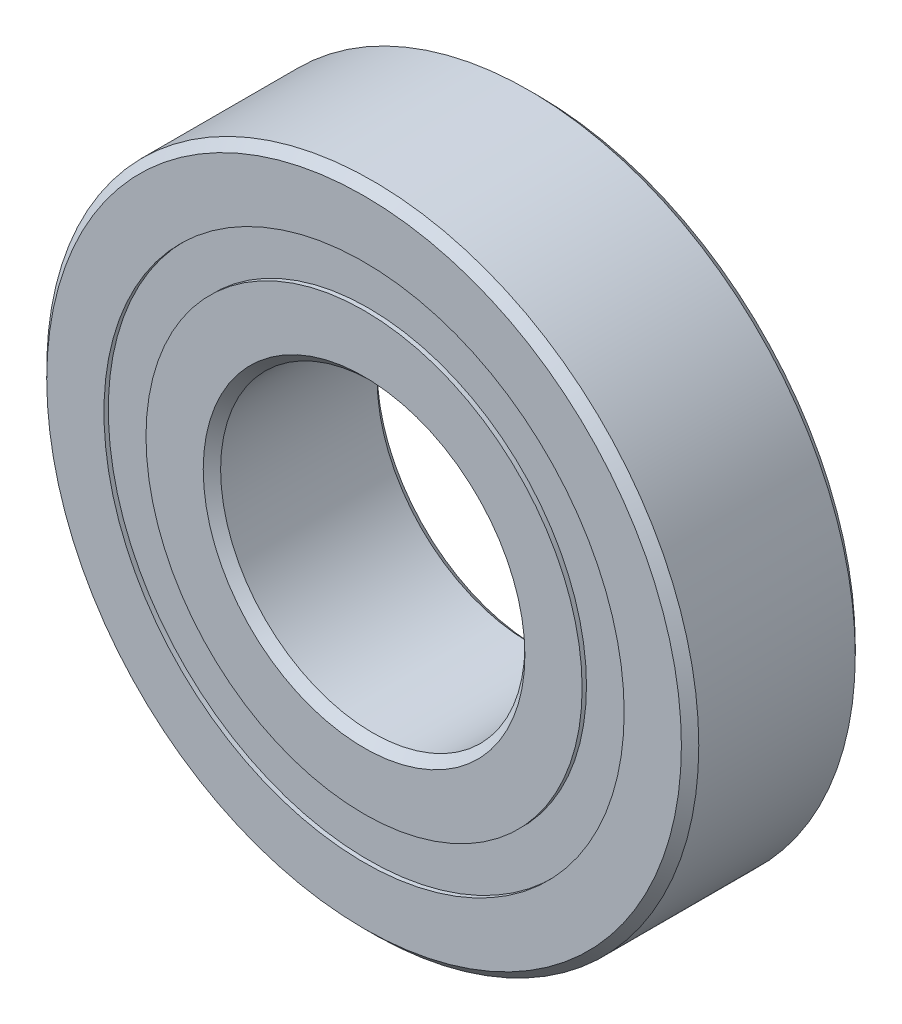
from build123d import *

# Parameters (mm, degrees)
CIRPATTERN1_COUNT = 12
SKETCH5_W         = 2.819764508
SKETCH5_H         = 3.07032967


with BuildPart() as part:
    # Sketch1 → Revolve1 (revolve)
    with BuildSketch(Plane(origin=(0, 0, 0), x_dir=(0, 0, -1), z_dir=(1, 0, 0)), mode=Mode.PRIVATE) as revolve1_sk:
        with BuildLine():
            Line((5.715, 23.8125), (-5.715, 23.8125))
            Line((-5.715, 23.8125), (-6.35, 23.1775))
            Line((-6.35, 23.1775), (-6.35, 18.997664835))
            Line((-6.35, 18.997664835), (-2.822222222, 18.997664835))
            ThreePointArc((-2.822222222, 18.997664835), (0, 20.675235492), (2.822222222, 18.997664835))
            Line((2.822222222, 18.997664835), (6.35, 18.997664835))
            Line((6.35, 18.997664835), (6.35, 23.1775))
            Line((6.35, 23.1775), (5.715, 23.8125))
        make_face()
    revolve(revolve1_sk.sketch.rotate(Axis((0, 0, 6.35), (0, 0, -1)), 90), axis=Axis((0, 0, 6.35), (0, 0, -1)))


with BuildPart() as body_2:
    # Sketch3 → Revolve3 (revolve)
    with BuildSketch(Plane(origin=(0, 0, 0), x_dir=(0, 0, -1), z_dir=(1, 0, 0)), mode=Mode.PRIVATE) as revolve3_sk:
        with BuildLine():
            Line((-6.35, 15.927335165), (-2.822222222, 15.927335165))
            ThreePointArc((-2.822222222, 15.927335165), (0, 14.249764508), (2.822222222, 15.927335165))
            Line((2.822222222, 15.927335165), (6.35, 15.927335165))
            Line((6.35, 15.927335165), (6.35, 11.7475))
            Line((6.35, 11.7475), (5.715, 11.1125))
            Line((5.715, 11.1125), (-5.715, 11.1125))
            Line((-5.715, 11.1125), (-6.35, 11.7475))
            Line((-6.35, 11.7475), (-6.35, 15.927335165))
        make_face()
    revolve(revolve3_sk.sketch.rotate(Axis((0, 0, 6.35), (0, 0, -1)), 90), axis=Axis((0, 0, 6.35), (0, 0, -1)))


with BuildPart() as body_3:
    # Sketch4 → Revolve4 (revolve)
    with BuildSketch(Plane(origin=(0, 0, 0), x_dir=(0, 0, -1), z_dir=(1, 0, 0))):
        with BuildLine():
            Line((-3.212735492, 17.4625), (3.212735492, 17.4625))
            ThreePointArc((3.212735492, 17.4625), (0, 20.675235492), (-3.212735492, 17.4625))
        make_face()
    revolve(axis=Axis((0, 17.4625, 3.212735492), (0, 0, -1)))


with BuildPart() as cirpattern1_1:
    # CirPattern1: pattern copy
    add(body_3.part.rotate(Axis((0, 0, 0), (0, 0, 1)), 1 * 360 / CIRPATTERN1_COUNT))


with BuildPart() as cirpattern1_2:
    # CirPattern1: pattern copy
    add(body_3.part.rotate(Axis((0, 0, 0), (0, 0, 1)), 2 * 360 / CIRPATTERN1_COUNT))


with BuildPart() as cirpattern1_3:
    # CirPattern1: pattern copy
    add(body_3.part.rotate(Axis((0, 0, 0), (0, 0, 1)), 3 * 360 / CIRPATTERN1_COUNT))


with BuildPart() as cirpattern1_4:
    # CirPattern1: pattern copy
    add(body_3.part.rotate(Axis((0, 0, 0), (0, 0, 1)), 4 * 360 / CIRPATTERN1_COUNT))


with BuildPart() as cirpattern1_5:
    # CirPattern1: pattern copy
    add(body_3.part.rotate(Axis((0, 0, 0), (0, 0, 1)), 5 * 360 / CIRPATTERN1_COUNT))


with BuildPart() as cirpattern1_6:
    # CirPattern1: pattern copy
    add(body_3.part.rotate(Axis((0, 0, 0), (0, 0, 1)), 6 * 360 / CIRPATTERN1_COUNT))


with BuildPart() as cirpattern1_7:
    # CirPattern1: pattern copy
    add(body_3.part.rotate(Axis((0, 0, 0), (0, 0, 1)), 7 * 360 / CIRPATTERN1_COUNT))


with BuildPart() as cirpattern1_8:
    # CirPattern1: pattern copy
    add(body_3.part.rotate(Axis((0, 0, 0), (0, 0, 1)), 8 * 360 / CIRPATTERN1_COUNT))


with BuildPart() as cirpattern1_9:
    # CirPattern1: pattern copy
    add(body_3.part.rotate(Axis((0, 0, 0), (0, 0, 1)), 9 * 360 / CIRPATTERN1_COUNT))


with BuildPart() as cirpattern1_10:
    # CirPattern1: pattern copy
    add(body_3.part.rotate(Axis((0, 0, 0), (0, 0, 1)), 10 * 360 / CIRPATTERN1_COUNT))


with BuildPart() as cirpattern1_11:
    # CirPattern1: pattern copy
    add(body_3.part.rotate(Axis((0, 0, 0), (0, 0, 1)), 11 * 360 / CIRPATTERN1_COUNT))


with BuildPart() as body_15:
    # Sketch5 → Revolve5 (revolve)
    with BuildSketch(Plane(origin=(0, 0, 0), x_dir=(0, 0, -1), z_dir=(1, 0, 0)), mode=Mode.PRIVATE) as revolve5_sk:
        with Locations((-4.622617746, 17.4625)):
            Rectangle(SKETCH5_W, SKETCH5_H)
        with Locations((4.622617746, 17.4625)):
            Rectangle(SKETCH5_W, SKETCH5_H)
    revolve(revolve5_sk.sketch.rotate(Axis((0, 0, 6.35), (0, 0, -1)), 90), axis=Axis((0, 0, 6.35), (0, 0, -1)))


solid = Compound([part.part, body_2.part, body_3.part, cirpattern1_1.part, cirpattern1_2.part, cirpattern1_3.part, cirpattern1_4.part, cirpattern1_5.part, cirpattern1_6.part, cirpattern1_7.part, cirpattern1_8.part, cirpattern1_9.part, cirpattern1_10.part, cirpattern1_11.part, body_15.part])
